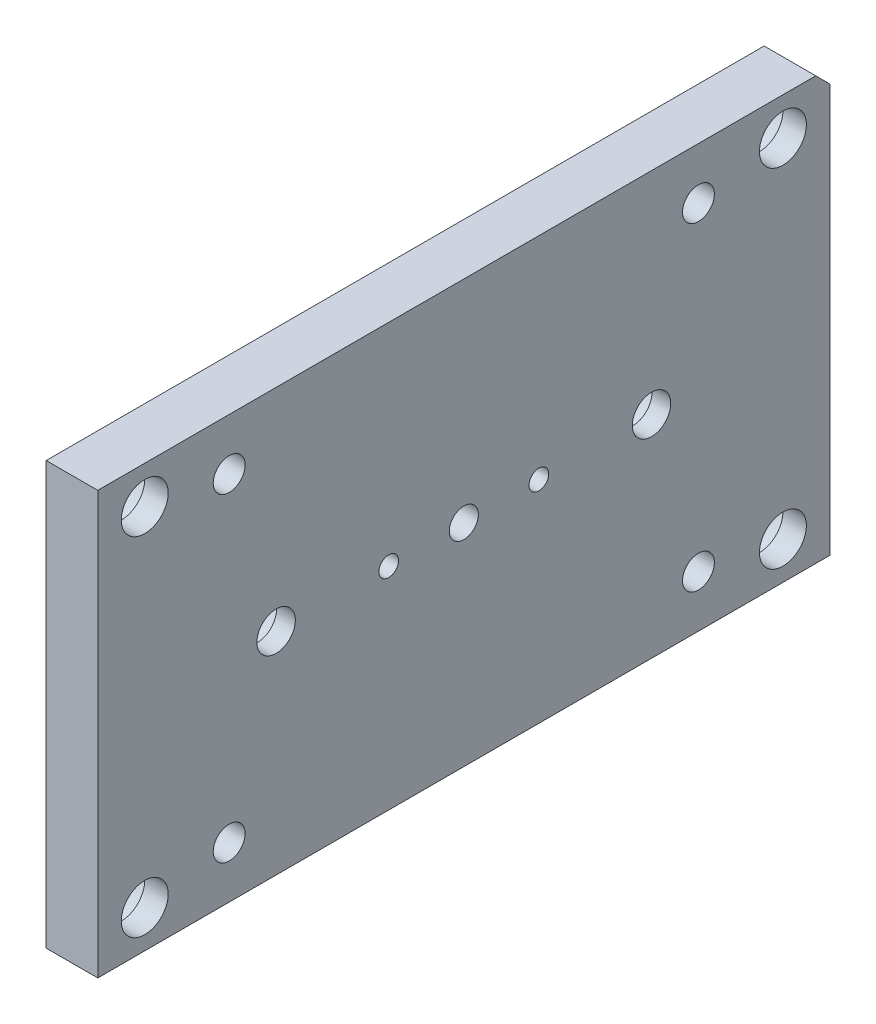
ISO-10303-21;
HEADER;
FILE_DESCRIPTION(('STEP AP214'),'2;1');
FILE_NAME('part.step','',(''),(''),'','','');
FILE_SCHEMA(('AUTOMOTIVE_DESIGN { 1 0 10303 214 1 1 1 1 }'));
ENDSEC;
DATA;
#1=APPLICATION_CONTEXT('core data for automotive mechanical design processes');
#2=APPLICATION_PROTOCOL_DEFINITION('international standard','automotive_design',2000,#1);
#3=PRODUCT_CONTEXT('',#1,'mechanical');
#4=PRODUCT('Part','Part','',(#3));
#5=PRODUCT_RELATED_PRODUCT_CATEGORY('part','',(#4));
#6=PRODUCT_DEFINITION_FORMATION('','',#4);
#7=PRODUCT_DEFINITION_CONTEXT('part definition',#1,'design');
#8=PRODUCT_DEFINITION('design','',#6,#7);
#9=PRODUCT_DEFINITION_SHAPE('','',#8);
#10=(LENGTH_UNIT() NAMED_UNIT(*) SI_UNIT(.MILLI.,.METRE.));
#11=(NAMED_UNIT(*) PLANE_ANGLE_UNIT() SI_UNIT($,.RADIAN.));
#12=(NAMED_UNIT(*) SI_UNIT($,.STERADIAN.) SOLID_ANGLE_UNIT());
#13=UNCERTAINTY_MEASURE_WITH_UNIT(LENGTH_MEASURE(1.E-05),#10,'distance_accuracy_value','');
#14=(GEOMETRIC_REPRESENTATION_CONTEXT(3) GLOBAL_UNCERTAINTY_ASSIGNED_CONTEXT((#13)) GLOBAL_UNIT_ASSIGNED_CONTEXT((#10,
#11,#12)) REPRESENTATION_CONTEXT('',''));
#15=CARTESIAN_POINT('',(0.,0.,0.));
#16=DIRECTION('',(0.,0.,1.));
#17=DIRECTION('',(1.,0.,0.));
#18=AXIS2_PLACEMENT_3D('',#15,#16,#17);
#19=CARTESIAN_POINT('',(11.,0.,40.));
#20=DIRECTION('',(-1.,0.,0.));
#21=DIRECTION('',(0.,0.,1.));
#22=AXIS2_PLACEMENT_3D('',#19,#20,#21);
#23=CYLINDRICAL_SURFACE('',#22,4.1);
#24=CARTESIAN_POINT('',(11.,0.,40.));
#25=DIRECTION('',(-1.,0.,0.));
#26=DIRECTION('',(0.,0.,1.));
#27=AXIS2_PLACEMENT_3D('',#24,#25,#26);
#28=CIRCLE('',#27,4.1);
#29=CARTESIAN_POINT('',(11.,0.,44.1));
#30=VERTEX_POINT('',#29);
#31=EDGE_CURVE('E236',#30,#30,#28,.T.);
#32=ORIENTED_EDGE('',*,*,#31,.F.);
#33=EDGE_LOOP('',(#32));
#34=FACE_BOUND('',#33,.T.);
#35=CARTESIAN_POINT('',(7.,0.,40.));
#36=DIRECTION('',(-1.,0.,0.));
#37=DIRECTION('',(0.,0.,1.));
#38=AXIS2_PLACEMENT_3D('',#35,#36,#37);
#39=CIRCLE('',#38,4.1);
#40=CARTESIAN_POINT('',(7.,0.,44.1));
#41=VERTEX_POINT('',#40);
#42=EDGE_CURVE('E149',#41,#41,#39,.F.);
#43=ORIENTED_EDGE('',*,*,#42,.F.);
#44=EDGE_LOOP('',(#43));
#45=FACE_BOUND('',#44,.T.);
#46=ADVANCED_FACE('F35',(#34,#45),#23,.F.);
#47=CARTESIAN_POINT('',(11.,0.,-40.));
#48=DIRECTION('',(-1.,0.,0.));
#49=DIRECTION('',(0.,0.,1.));
#50=AXIS2_PLACEMENT_3D('',#47,#48,#49);
#51=CYLINDRICAL_SURFACE('',#50,4.1);
#52=CARTESIAN_POINT('',(11.,0.,-40.));
#53=DIRECTION('',(-1.,0.,0.));
#54=DIRECTION('',(0.,0.,1.));
#55=AXIS2_PLACEMENT_3D('',#52,#53,#54);
#56=CIRCLE('',#55,4.1);
#57=CARTESIAN_POINT('',(11.,0.,-35.9));
#58=VERTEX_POINT('',#57);
#59=EDGE_CURVE('E242',#58,#58,#56,.T.);
#60=ORIENTED_EDGE('',*,*,#59,.F.);
#61=EDGE_LOOP('',(#60));
#62=FACE_BOUND('',#61,.T.);
#63=CARTESIAN_POINT('',(7.,0.,-40.));
#64=DIRECTION('',(-1.,0.,0.));
#65=DIRECTION('',(0.,0.,1.));
#66=AXIS2_PLACEMENT_3D('',#63,#64,#65);
#67=CIRCLE('',#66,4.1);
#68=CARTESIAN_POINT('',(7.,0.,-35.9));
#69=VERTEX_POINT('',#68);
#70=EDGE_CURVE('E144',#69,#69,#67,.F.);
#71=ORIENTED_EDGE('',*,*,#70,.F.);
#72=EDGE_LOOP('',(#71));
#73=FACE_BOUND('',#72,.T.);
#74=ADVANCED_FACE('F270',(#62,#73),#51,.F.);
#75=CARTESIAN_POINT('',(11.,0.,16.));
#76=DIRECTION('',(-1.,0.,0.));
#77=DIRECTION('',(0.,0.,1.));
#78=AXIS2_PLACEMENT_3D('',#75,#76,#77);
#79=CYLINDRICAL_SURFACE('',#78,2.1);
#80=CARTESIAN_POINT('',(11.,0.,16.));
#81=DIRECTION('',(-1.,0.,0.));
#82=DIRECTION('',(0.,0.,1.));
#83=AXIS2_PLACEMENT_3D('',#80,#81,#82);
#84=CIRCLE('',#83,2.1);
#85=CARTESIAN_POINT('',(11.,0.,18.1));
#86=VERTEX_POINT('',#85);
#87=EDGE_CURVE('E215',#86,#86,#84,.T.);
#88=ORIENTED_EDGE('',*,*,#87,.F.);
#89=EDGE_LOOP('',(#88));
#90=FACE_BOUND('',#89,.T.);
#91=CARTESIAN_POINT('',(4.,0.,16.));
#92=DIRECTION('',(-1.,0.,0.));
#93=DIRECTION('',(0.,0.,1.));
#94=AXIS2_PLACEMENT_3D('',#91,#92,#93);
#95=CIRCLE('',#94,2.1);
#96=CARTESIAN_POINT('',(4.,0.,18.1));
#97=VERTEX_POINT('',#96);
#98=EDGE_CURVE('E139',#97,#97,#95,.F.);
#99=ORIENTED_EDGE('',*,*,#98,.F.);
#100=EDGE_LOOP('',(#99));
#101=FACE_BOUND('',#100,.T.);
#102=ADVANCED_FACE('F276',(#90,#101),#79,.F.);
#103=CARTESIAN_POINT('',(11.,0.,-16.));
#104=DIRECTION('',(-1.,0.,0.));
#105=DIRECTION('',(0.,0.,1.));
#106=AXIS2_PLACEMENT_3D('',#103,#104,#105);
#107=CYLINDRICAL_SURFACE('',#106,2.1);
#108=CARTESIAN_POINT('',(11.,0.,-16.));
#109=DIRECTION('',(-1.,0.,0.));
#110=DIRECTION('',(0.,0.,1.));
#111=AXIS2_PLACEMENT_3D('',#108,#109,#110);
#112=CIRCLE('',#111,2.1);
#113=CARTESIAN_POINT('',(11.,0.,-13.9));
#114=VERTEX_POINT('',#113);
#115=EDGE_CURVE('E218',#114,#114,#112,.T.);
#116=ORIENTED_EDGE('',*,*,#115,.F.);
#117=EDGE_LOOP('',(#116));
#118=FACE_BOUND('',#117,.T.);
#119=CARTESIAN_POINT('',(4.,0.,-16.));
#120=DIRECTION('',(-1.,0.,0.));
#121=DIRECTION('',(0.,0.,1.));
#122=AXIS2_PLACEMENT_3D('',#119,#120,#121);
#123=CIRCLE('',#122,2.1);
#124=CARTESIAN_POINT('',(4.,0.,-13.9));
#125=VERTEX_POINT('',#124);
#126=EDGE_CURVE('E134',#125,#125,#123,.F.);
#127=ORIENTED_EDGE('',*,*,#126,.F.);
#128=EDGE_LOOP('',(#127));
#129=FACE_BOUND('',#128,.T.);
#130=ADVANCED_FACE('F339',(#118,#129),#107,.F.);
#131=CARTESIAN_POINT('',(11.,-37.,-68.));
#132=DIRECTION('',(-1.,0.,0.));
#133=DIRECTION('',(0.,0.,1.));
#134=AXIS2_PLACEMENT_3D('',#131,#132,#133);
#135=CYLINDRICAL_SURFACE('',#134,4.99999999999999);
#136=CARTESIAN_POINT('',(11.,-37.,-68.));
#137=DIRECTION('',(-1.,0.,0.));
#138=DIRECTION('',(0.,0.,1.));
#139=AXIS2_PLACEMENT_3D('',#136,#137,#138);
#140=CIRCLE('',#139,4.99999999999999);
#141=CARTESIAN_POINT('',(11.,-37.,-63.));
#142=VERTEX_POINT('',#141);
#143=EDGE_CURVE('E225',#142,#142,#140,.T.);
#144=ORIENTED_EDGE('',*,*,#143,.F.);
#145=EDGE_LOOP('',(#144));
#146=FACE_BOUND('',#145,.T.);
#147=CARTESIAN_POINT('',(6.,-37.,-68.));
#148=DIRECTION('',(-1.,0.,0.));
#149=DIRECTION('',(0.,0.,1.));
#150=AXIS2_PLACEMENT_3D('',#147,#148,#149);
#151=CIRCLE('',#150,4.99999999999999);
#152=CARTESIAN_POINT('',(6.,-37.,-63.));
#153=VERTEX_POINT('',#152);
#154=EDGE_CURVE('E129',#153,#153,#151,.F.);
#155=ORIENTED_EDGE('',*,*,#154,.F.);
#156=EDGE_LOOP('',(#155));
#157=FACE_BOUND('',#156,.T.);
#158=ADVANCED_FACE('F342',(#146,#157),#135,.F.);
#159=CARTESIAN_POINT('',(11.,-37.,68.));
#160=DIRECTION('',(-1.,0.,0.));
#161=DIRECTION('',(0.,0.,1.));
#162=AXIS2_PLACEMENT_3D('',#159,#160,#161);
#163=CYLINDRICAL_SURFACE('',#162,4.99999999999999);
#164=CARTESIAN_POINT('',(11.,-37.,68.));
#165=DIRECTION('',(-1.,0.,0.));
#166=DIRECTION('',(0.,0.,1.));
#167=AXIS2_PLACEMENT_3D('',#164,#165,#166);
#168=CIRCLE('',#167,4.99999999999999);
#169=CARTESIAN_POINT('',(11.,-37.,73.));
#170=VERTEX_POINT('',#169);
#171=EDGE_CURVE('E230',#170,#170,#168,.T.);
#172=ORIENTED_EDGE('',*,*,#171,.F.);
#173=EDGE_LOOP('',(#172));
#174=FACE_BOUND('',#173,.T.);
#175=CARTESIAN_POINT('',(6.,-37.,68.));
#176=DIRECTION('',(-1.,0.,0.));
#177=DIRECTION('',(0.,0.,1.));
#178=AXIS2_PLACEMENT_3D('',#175,#176,#177);
#179=CIRCLE('',#178,4.99999999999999);
#180=CARTESIAN_POINT('',(6.,-37.,73.));
#181=VERTEX_POINT('',#180);
#182=EDGE_CURVE('E124',#181,#181,#179,.F.);
#183=ORIENTED_EDGE('',*,*,#182,.F.);
#184=EDGE_LOOP('',(#183));
#185=FACE_BOUND('',#184,.T.);
#186=ADVANCED_FACE('F346',(#174,#185),#163,.F.);
#187=CARTESIAN_POINT('',(11.,37.,68.));
#188=DIRECTION('',(-1.,0.,0.));
#189=DIRECTION('',(0.,0.,1.));
#190=AXIS2_PLACEMENT_3D('',#187,#188,#189);
#191=CYLINDRICAL_SURFACE('',#190,4.99999999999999);
#192=CARTESIAN_POINT('',(11.,37.,68.));
#193=DIRECTION('',(-1.,0.,0.));
#194=DIRECTION('',(0.,0.,1.));
#195=AXIS2_PLACEMENT_3D('',#192,#193,#194);
#196=CIRCLE('',#195,4.99999999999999);
#197=CARTESIAN_POINT('',(11.,37.,73.));
#198=VERTEX_POINT('',#197);
#199=EDGE_CURVE('E233',#198,#198,#196,.T.);
#200=ORIENTED_EDGE('',*,*,#199,.F.);
#201=EDGE_LOOP('',(#200));
#202=FACE_BOUND('',#201,.T.);
#203=CARTESIAN_POINT('',(6.,37.,68.));
#204=DIRECTION('',(-1.,0.,0.));
#205=DIRECTION('',(0.,0.,1.));
#206=AXIS2_PLACEMENT_3D('',#203,#204,#205);
#207=CIRCLE('',#206,4.99999999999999);
#208=CARTESIAN_POINT('',(6.,37.,73.));
#209=VERTEX_POINT('',#208);
#210=EDGE_CURVE('E119',#209,#209,#207,.F.);
#211=ORIENTED_EDGE('',*,*,#210,.F.);
#212=EDGE_LOOP('',(#211));
#213=FACE_BOUND('',#212,.T.);
#214=ADVANCED_FACE('F283',(#202,#213),#191,.F.);
#215=CARTESIAN_POINT('',(11.,37.,-68.));
#216=DIRECTION('',(-1.,0.,0.));
#217=DIRECTION('',(0.,0.,1.));
#218=AXIS2_PLACEMENT_3D('',#215,#216,#217);
#219=CYLINDRICAL_SURFACE('',#218,4.99999999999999);
#220=CARTESIAN_POINT('',(11.,37.,-68.));
#221=DIRECTION('',(-1.,0.,0.));
#222=DIRECTION('',(0.,0.,1.));
#223=AXIS2_PLACEMENT_3D('',#220,#221,#222);
#224=CIRCLE('',#223,4.99999999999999);
#225=CARTESIAN_POINT('',(11.,37.,-63.));
#226=VERTEX_POINT('',#225);
#227=EDGE_CURVE('E239',#226,#226,#224,.T.);
#228=ORIENTED_EDGE('',*,*,#227,.F.);
#229=EDGE_LOOP('',(#228));
#230=FACE_BOUND('',#229,.T.);
#231=CARTESIAN_POINT('',(6.,37.,-68.));
#232=DIRECTION('',(-1.,0.,0.));
#233=DIRECTION('',(0.,0.,1.));
#234=AXIS2_PLACEMENT_3D('',#231,#232,#233);
#235=CIRCLE('',#234,4.99999999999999);
#236=CARTESIAN_POINT('',(6.,37.,-63.));
#237=VERTEX_POINT('',#236);
#238=EDGE_CURVE('E114',#237,#237,#235,.F.);
#239=ORIENTED_EDGE('',*,*,#238,.F.);
#240=EDGE_LOOP('',(#239));
#241=FACE_BOUND('',#240,.T.);
#242=ADVANCED_FACE('F285',(#230,#241),#219,.F.);
#243=CARTESIAN_POINT('',(11.,45.,78.));
#244=DIRECTION('',(0.,0.,-1.));
#245=DIRECTION('',(-1.,0.,0.));
#246=AXIS2_PLACEMENT_3D('',#243,#244,#245);
#247=PLANE('',#246);
#248=DIRECTION('',(0.,-1.,0.));
#249=VECTOR('',#248,1.);
#250=CARTESIAN_POINT('',(0.,45.,78.));
#251=LINE('',#250,#249);
#252=CARTESIAN_POINT('',(0.,45.,78.));
#253=VERTEX_POINT('',#252);
#254=CARTESIAN_POINT('',(0.,-45.,78.));
#255=VERTEX_POINT('',#254);
#256=EDGE_CURVE('E105',#253,#255,#251,.T.);
#257=ORIENTED_EDGE('',*,*,#256,.T.);
#258=DIRECTION('',(-1.,0.,0.));
#259=VECTOR('',#258,1.);
#260=CARTESIAN_POINT('',(11.,-45.,78.));
#261=LINE('',#260,#259);
#262=CARTESIAN_POINT('',(11.,-45.,78.));
#263=VERTEX_POINT('',#262);
#264=EDGE_CURVE('E86',#263,#255,#261,.T.);
#265=ORIENTED_EDGE('',*,*,#264,.F.);
#266=DIRECTION('',(0.,-1.,0.));
#267=VECTOR('',#266,1.);
#268=CARTESIAN_POINT('',(11.,45.,78.));
#269=LINE('',#268,#267);
#270=CARTESIAN_POINT('',(11.,45.,78.));
#271=VERTEX_POINT('',#270);
#272=EDGE_CURVE('E92',#271,#263,#269,.T.);
#273=ORIENTED_EDGE('',*,*,#272,.F.);
#274=DIRECTION('',(-1.,0.,0.));
#275=VECTOR('',#274,1.);
#276=CARTESIAN_POINT('',(11.,45.,78.));
#277=LINE('',#276,#275);
#278=EDGE_CURVE('E110',#271,#253,#277,.T.);
#279=ORIENTED_EDGE('',*,*,#278,.T.);
#280=EDGE_LOOP('',(#257,#265,#273,#279));
#281=FACE_BOUND('',#280,.T.);
#282=ADVANCED_FACE('F103',(#281),#247,.F.);
#283=CARTESIAN_POINT('',(11.,-45.,78.));
#284=DIRECTION('',(0.,1.,0.));
#285=DIRECTION('',(0.,0.,1.));
#286=AXIS2_PLACEMENT_3D('',#283,#284,#285);
#287=PLANE('',#286);
#288=DIRECTION('',(0.,0.,-1.));
#289=VECTOR('',#288,1.);
#290=CARTESIAN_POINT('',(0.,-45.,78.));
#291=LINE('',#290,#289);
#292=CARTESIAN_POINT('',(0.,-45.,-78.));
#293=VERTEX_POINT('',#292);
#294=EDGE_CURVE('E248',#255,#293,#291,.T.);
#295=ORIENTED_EDGE('',*,*,#294,.T.);
#296=DIRECTION('',(-1.,0.,0.));
#297=VECTOR('',#296,1.);
#298=CARTESIAN_POINT('',(11.,-45.,-78.));
#299=LINE('',#298,#297);
#300=CARTESIAN_POINT('',(11.,-45.,-78.));
#301=VERTEX_POINT('',#300);
#302=EDGE_CURVE('E89',#301,#293,#299,.T.);
#303=ORIENTED_EDGE('',*,*,#302,.F.);
#304=DIRECTION('',(0.,0.,-1.));
#305=VECTOR('',#304,1.);
#306=CARTESIAN_POINT('',(11.,-45.,78.));
#307=LINE('',#306,#305);
#308=EDGE_CURVE('E82',#263,#301,#307,.T.);
#309=ORIENTED_EDGE('',*,*,#308,.F.);
#310=ORIENTED_EDGE('',*,*,#264,.T.);
#311=EDGE_LOOP('',(#295,#303,#309,#310));
#312=FACE_BOUND('',#311,.T.);
#313=ADVANCED_FACE('F84',(#312),#287,.F.);
#314=CARTESIAN_POINT('',(11.,45.,-78.));
#315=DIRECTION('',(0.,0.,1.));
#316=DIRECTION('',(1.,0.,0.));
#317=AXIS2_PLACEMENT_3D('',#314,#315,#316);
#318=PLANE('',#317);
#319=DIRECTION('',(0.,1.,0.));
#320=VECTOR('',#319,1.);
#321=CARTESIAN_POINT('',(0.,45.,-78.));
#322=LINE('',#321,#320);
#323=CARTESIAN_POINT('',(0.,42.,-78.));
#324=VERTEX_POINT('',#323);
#325=EDGE_CURVE('E250',#293,#324,#322,.T.);
#326=ORIENTED_EDGE('',*,*,#325,.T.);
#327=DIRECTION('',(1.,0.,0.));
#328=VECTOR('',#327,1.);
#329=CARTESIAN_POINT('',(11.,42.,-78.));
#330=LINE('',#329,#328);
#331=CARTESIAN_POINT('',(11.,42.,-78.));
#332=VERTEX_POINT('',#331);
#333=EDGE_CURVE('E43',#324,#332,#330,.T.);
#334=ORIENTED_EDGE('',*,*,#333,.T.);
#335=DIRECTION('',(0.,1.,0.));
#336=VECTOR('',#335,1.);
#337=CARTESIAN_POINT('',(11.,45.,-78.));
#338=LINE('',#337,#336);
#339=EDGE_CURVE('E91',#301,#332,#338,.T.);
#340=ORIENTED_EDGE('',*,*,#339,.F.);
#341=ORIENTED_EDGE('',*,*,#302,.T.);
#342=EDGE_LOOP('',(#326,#334,#340,#341));
#343=FACE_BOUND('',#342,.T.);
#344=ADVANCED_FACE('F254',(#343),#318,.F.);
#345=CARTESIAN_POINT('',(11.,45.,78.));
#346=DIRECTION('',(0.,-1.,0.));
#347=DIRECTION('',(0.,0.,-1.));
#348=AXIS2_PLACEMENT_3D('',#345,#346,#347);
#349=PLANE('',#348);
#350=DIRECTION('',(0.,0.,1.));
#351=VECTOR('',#350,1.);
#352=CARTESIAN_POINT('',(11.,45.,78.));
#353=LINE('',#352,#351);
#354=CARTESIAN_POINT('',(11.,45.,-75.));
#355=VERTEX_POINT('',#354);
#356=EDGE_CURVE('E97',#355,#271,#353,.T.);
#357=ORIENTED_EDGE('',*,*,#356,.F.);
#358=DIRECTION('',(-1.,0.,0.));
#359=VECTOR('',#358,1.);
#360=CARTESIAN_POINT('',(11.,45.,-75.));
#361=LINE('',#360,#359);
#362=CARTESIAN_POINT('',(0.,45.,-75.));
#363=VERTEX_POINT('',#362);
#364=EDGE_CURVE('E106',#355,#363,#361,.T.);
#365=ORIENTED_EDGE('',*,*,#364,.T.);
#366=DIRECTION('',(0.,0.,1.));
#367=VECTOR('',#366,1.);
#368=CARTESIAN_POINT('',(0.,45.,78.));
#369=LINE('',#368,#367);
#370=EDGE_CURVE('E101',#363,#253,#369,.T.);
#371=ORIENTED_EDGE('',*,*,#370,.T.);
#372=ORIENTED_EDGE('',*,*,#278,.F.);
#373=EDGE_LOOP('',(#357,#365,#371,#372));
#374=FACE_BOUND('',#373,.T.);
#375=ADVANCED_FACE('F258',(#374),#349,.F.);
#376=CARTESIAN_POINT('',(11.,-45.,78.));
#377=DIRECTION('',(1.,0.,0.));
#378=DIRECTION('',(0.,0.,-1.));
#379=AXIS2_PLACEMENT_3D('',#376,#377,#378);
#380=PLANE('',#379);
#381=CARTESIAN_POINT('',(11.,34.,50.));
#382=DIRECTION('',(-1.,0.,0.));
#383=DIRECTION('',(0.,0.,1.));
#384=AXIS2_PLACEMENT_3D('',#381,#382,#383);
#385=CIRCLE('',#384,3.4);
#386=CARTESIAN_POINT('',(11.,34.,53.4));
#387=VERTEX_POINT('',#386);
#388=EDGE_CURVE('E117',#387,#387,#385,.T.);
#389=ORIENTED_EDGE('',*,*,#388,.T.);
#390=EDGE_LOOP('',(#389));
#391=FACE_BOUND('',#390,.T.);
#392=CARTESIAN_POINT('',(11.,34.,-50.));
#393=DIRECTION('',(-1.,0.,0.));
#394=DIRECTION('',(0.,0.,1.));
#395=AXIS2_PLACEMENT_3D('',#392,#393,#394);
#396=CIRCLE('',#395,3.4);
#397=CARTESIAN_POINT('',(11.,34.,-46.6));
#398=VERTEX_POINT('',#397);
#399=EDGE_CURVE('E197',#398,#398,#396,.T.);
#400=ORIENTED_EDGE('',*,*,#399,.T.);
#401=EDGE_LOOP('',(#400));
#402=FACE_BOUND('',#401,.T.);
#403=CARTESIAN_POINT('',(11.,-34.,-50.));
#404=DIRECTION('',(-1.,0.,0.));
#405=DIRECTION('',(0.,0.,1.));
#406=AXIS2_PLACEMENT_3D('',#403,#404,#405);
#407=CIRCLE('',#406,3.4);
#408=CARTESIAN_POINT('',(11.,-34.,-46.6));
#409=VERTEX_POINT('',#408);
#410=EDGE_CURVE('E203',#409,#409,#407,.T.);
#411=ORIENTED_EDGE('',*,*,#410,.T.);
#412=EDGE_LOOP('',(#411));
#413=FACE_BOUND('',#412,.T.);
#414=CARTESIAN_POINT('',(11.,-34.,50.));
#415=DIRECTION('',(-1.,0.,0.));
#416=DIRECTION('',(0.,0.,1.));
#417=AXIS2_PLACEMENT_3D('',#414,#415,#416);
#418=CIRCLE('',#417,3.4);
#419=CARTESIAN_POINT('',(11.,-34.,53.4));
#420=VERTEX_POINT('',#419);
#421=EDGE_CURVE('E209',#420,#420,#418,.T.);
#422=ORIENTED_EDGE('',*,*,#421,.T.);
#423=EDGE_LOOP('',(#422));
#424=FACE_BOUND('',#423,.T.);
#425=ORIENTED_EDGE('',*,*,#87,.T.);
#426=EDGE_LOOP('',(#425));
#427=FACE_BOUND('',#426,.T.);
#428=ORIENTED_EDGE('',*,*,#115,.T.);
#429=EDGE_LOOP('',(#428));
#430=FACE_BOUND('',#429,.T.);
#431=CARTESIAN_POINT('',(11.,0.,0.));
#432=DIRECTION('',(-1.,0.,0.));
#433=DIRECTION('',(0.,0.,1.));
#434=AXIS2_PLACEMENT_3D('',#431,#432,#433);
#435=CIRCLE('',#434,3.1);
#436=CARTESIAN_POINT('',(11.,0.,3.09999999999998));
#437=VERTEX_POINT('',#436);
#438=EDGE_CURVE('E222',#437,#437,#435,.T.);
#439=ORIENTED_EDGE('',*,*,#438,.T.);
#440=EDGE_LOOP('',(#439));
#441=FACE_BOUND('',#440,.T.);
#442=ORIENTED_EDGE('',*,*,#143,.T.);
#443=EDGE_LOOP('',(#442));
#444=FACE_BOUND('',#443,.T.);
#445=ORIENTED_EDGE('',*,*,#171,.T.);
#446=EDGE_LOOP('',(#445));
#447=FACE_BOUND('',#446,.T.);
#448=ORIENTED_EDGE('',*,*,#199,.T.);
#449=EDGE_LOOP('',(#448));
#450=FACE_BOUND('',#449,.T.);
#451=ORIENTED_EDGE('',*,*,#31,.T.);
#452=EDGE_LOOP('',(#451));
#453=FACE_BOUND('',#452,.T.);
#454=ORIENTED_EDGE('',*,*,#227,.T.);
#455=EDGE_LOOP('',(#454));
#456=FACE_BOUND('',#455,.T.);
#457=ORIENTED_EDGE('',*,*,#59,.T.);
#458=EDGE_LOOP('',(#457));
#459=FACE_BOUND('',#458,.T.);
#460=ORIENTED_EDGE('',*,*,#339,.T.);
#461=DIRECTION('',(0.,-0.707106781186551,-0.707106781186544));
#462=VECTOR('',#461,1.);
#463=CARTESIAN_POINT('',(11.,76.4999999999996,-43.5000000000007));
#464=LINE('',#463,#462);
#465=EDGE_CURVE('E11',#332,#355,#464,.F.);
#466=ORIENTED_EDGE('',*,*,#465,.T.);
#467=ORIENTED_EDGE('',*,*,#356,.T.);
#468=ORIENTED_EDGE('',*,*,#272,.T.);
#469=ORIENTED_EDGE('',*,*,#308,.T.);
#470=EDGE_LOOP('',(#460,#466,#467,#468,#469));
#471=FACE_BOUND('',#470,.T.);
#472=ADVANCED_FACE('F95',(#391,#402,#413,#424,#427,#430,#441,#444,#447,#450,#453,#456,#459,
#471),#380,.T.);
#473=CARTESIAN_POINT('',(0.,-45.,78.));
#474=DIRECTION('',(1.,0.,0.));
#475=DIRECTION('',(0.,0.,-1.));
#476=AXIS2_PLACEMENT_3D('',#473,#474,#475);
#477=PLANE('',#476);
#478=CARTESIAN_POINT('',(0.,0.,40.));
#479=DIRECTION('',(-1.,0.,0.));
#480=DIRECTION('',(0.,0.,1.));
#481=AXIS2_PLACEMENT_3D('',#478,#479,#480);
#482=CIRCLE('',#481,7.5);
#483=CARTESIAN_POINT('',(0.,0.,47.5));
#484=VERTEX_POINT('',#483);
#485=EDGE_CURVE('E159',#484,#484,#482,.T.);
#486=ORIENTED_EDGE('',*,*,#485,.F.);
#487=EDGE_LOOP('',(#486));
#488=FACE_BOUND('',#487,.T.);
#489=CARTESIAN_POINT('',(0.,0.,-40.));
#490=DIRECTION('',(-1.,0.,0.));
#491=DIRECTION('',(0.,0.,1.));
#492=AXIS2_PLACEMENT_3D('',#489,#490,#491);
#493=CIRCLE('',#492,7.5);
#494=CARTESIAN_POINT('',(0.,0.,-32.5));
#495=VERTEX_POINT('',#494);
#496=EDGE_CURVE('E151',#495,#495,#493,.T.);
#497=ORIENTED_EDGE('',*,*,#496,.F.);
#498=EDGE_LOOP('',(#497));
#499=FACE_BOUND('',#498,.T.);
#500=CARTESIAN_POINT('',(0.,0.,16.));
#501=DIRECTION('',(-1.,0.,0.));
#502=DIRECTION('',(0.,0.,1.));
#503=AXIS2_PLACEMENT_3D('',#500,#501,#502);
#504=CIRCLE('',#503,4.25);
#505=CARTESIAN_POINT('',(0.,0.,20.25));
#506=VERTEX_POINT('',#505);
#507=EDGE_CURVE('E147',#506,#506,#504,.T.);
#508=ORIENTED_EDGE('',*,*,#507,.F.);
#509=EDGE_LOOP('',(#508));
#510=FACE_BOUND('',#509,.T.);
#511=CARTESIAN_POINT('',(0.,0.,-16.));
#512=DIRECTION('',(-1.,0.,0.));
#513=DIRECTION('',(0.,0.,1.));
#514=AXIS2_PLACEMENT_3D('',#511,#512,#513);
#515=CIRCLE('',#514,4.25);
#516=CARTESIAN_POINT('',(0.,0.,-11.75));
#517=VERTEX_POINT('',#516);
#518=EDGE_CURVE('E142',#517,#517,#515,.T.);
#519=ORIENTED_EDGE('',*,*,#518,.F.);
#520=EDGE_LOOP('',(#519));
#521=FACE_BOUND('',#520,.T.);
#522=CARTESIAN_POINT('',(0.,-37.,-68.));
#523=DIRECTION('',(-1.,0.,0.));
#524=DIRECTION('',(0.,0.,1.));
#525=AXIS2_PLACEMENT_3D('',#522,#523,#524);
#526=CIRCLE('',#525,7.5);
#527=CARTESIAN_POINT('',(0.,-37.,-60.5));
#528=VERTEX_POINT('',#527);
#529=EDGE_CURVE('E137',#528,#528,#526,.T.);
#530=ORIENTED_EDGE('',*,*,#529,.F.);
#531=EDGE_LOOP('',(#530));
#532=FACE_BOUND('',#531,.T.);
#533=CARTESIAN_POINT('',(0.,-37.,68.));
#534=DIRECTION('',(-1.,0.,0.));
#535=DIRECTION('',(0.,0.,1.));
#536=AXIS2_PLACEMENT_3D('',#533,#534,#535);
#537=CIRCLE('',#536,7.50000000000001);
#538=CARTESIAN_POINT('',(0.,-37.,75.5));
#539=VERTEX_POINT('',#538);
#540=EDGE_CURVE('E132',#539,#539,#537,.T.);
#541=ORIENTED_EDGE('',*,*,#540,.F.);
#542=EDGE_LOOP('',(#541));
#543=FACE_BOUND('',#542,.T.);
#544=CARTESIAN_POINT('',(0.,37.,68.));
#545=DIRECTION('',(-1.,0.,0.));
#546=DIRECTION('',(0.,0.,1.));
#547=AXIS2_PLACEMENT_3D('',#544,#545,#546);
#548=CIRCLE('',#547,7.50000000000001);
#549=CARTESIAN_POINT('',(0.,37.,75.5));
#550=VERTEX_POINT('',#549);
#551=EDGE_CURVE('E127',#550,#550,#548,.T.);
#552=ORIENTED_EDGE('',*,*,#551,.F.);
#553=EDGE_LOOP('',(#552));
#554=FACE_BOUND('',#553,.T.);
#555=CARTESIAN_POINT('',(0.,37.,-68.));
#556=DIRECTION('',(-1.,0.,0.));
#557=DIRECTION('',(0.,0.,1.));
#558=AXIS2_PLACEMENT_3D('',#555,#556,#557);
#559=CIRCLE('',#558,7.5);
#560=CARTESIAN_POINT('',(0.,37.,-60.5));
#561=VERTEX_POINT('',#560);
#562=EDGE_CURVE('E122',#561,#561,#559,.T.);
#563=ORIENTED_EDGE('',*,*,#562,.F.);
#564=EDGE_LOOP('',(#563));
#565=FACE_BOUND('',#564,.T.);
#566=CARTESIAN_POINT('',(0.,34.,50.));
#567=DIRECTION('',(-1.,0.,0.));
#568=DIRECTION('',(0.,0.,1.));
#569=AXIS2_PLACEMENT_3D('',#566,#567,#568);
#570=CIRCLE('',#569,3.39999999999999);
#571=CARTESIAN_POINT('',(0.,34.,53.4));
#572=VERTEX_POINT('',#571);
#573=EDGE_CURVE('E194',#572,#572,#570,.T.);
#574=ORIENTED_EDGE('',*,*,#573,.F.);
#575=EDGE_LOOP('',(#574));
#576=FACE_BOUND('',#575,.T.);
#577=CARTESIAN_POINT('',(0.,34.,-50.));
#578=DIRECTION('',(-1.,0.,0.));
#579=DIRECTION('',(0.,0.,1.));
#580=AXIS2_PLACEMENT_3D('',#577,#578,#579);
#581=CIRCLE('',#580,3.39999999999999);
#582=CARTESIAN_POINT('',(0.,34.,-46.6));
#583=VERTEX_POINT('',#582);
#584=EDGE_CURVE('E200',#583,#583,#581,.T.);
#585=ORIENTED_EDGE('',*,*,#584,.F.);
#586=EDGE_LOOP('',(#585));
#587=FACE_BOUND('',#586,.T.);
#588=CARTESIAN_POINT('',(0.,-34.,-50.));
#589=DIRECTION('',(-1.,0.,0.));
#590=DIRECTION('',(0.,0.,1.));
#591=AXIS2_PLACEMENT_3D('',#588,#589,#590);
#592=CIRCLE('',#591,3.39999999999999);
#593=CARTESIAN_POINT('',(0.,-34.,-46.6));
#594=VERTEX_POINT('',#593);
#595=EDGE_CURVE('E206',#594,#594,#592,.T.);
#596=ORIENTED_EDGE('',*,*,#595,.F.);
#597=EDGE_LOOP('',(#596));
#598=FACE_BOUND('',#597,.T.);
#599=CARTESIAN_POINT('',(0.,-34.,50.));
#600=DIRECTION('',(-1.,0.,0.));
#601=DIRECTION('',(0.,0.,1.));
#602=AXIS2_PLACEMENT_3D('',#599,#600,#601);
#603=CIRCLE('',#602,3.39999999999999);
#604=CARTESIAN_POINT('',(0.,-34.,53.4));
#605=VERTEX_POINT('',#604);
#606=EDGE_CURVE('E212',#605,#605,#603,.T.);
#607=ORIENTED_EDGE('',*,*,#606,.F.);
#608=EDGE_LOOP('',(#607));
#609=FACE_BOUND('',#608,.T.);
#610=CARTESIAN_POINT('',(0.,0.,0.));
#611=DIRECTION('',(-1.,0.,0.));
#612=DIRECTION('',(0.,0.,1.));
#613=AXIS2_PLACEMENT_3D('',#610,#611,#612);
#614=CIRCLE('',#613,3.1);
#615=CARTESIAN_POINT('',(0.,0.,3.09999999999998));
#616=VERTEX_POINT('',#615);
#617=EDGE_CURVE('E221',#616,#616,#614,.T.);
#618=ORIENTED_EDGE('',*,*,#617,.F.);
#619=EDGE_LOOP('',(#618));
#620=FACE_BOUND('',#619,.T.);
#621=ORIENTED_EDGE('',*,*,#370,.F.);
#622=DIRECTION('',(0.,0.707106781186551,0.707106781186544));
#623=VECTOR('',#622,1.);
#624=CARTESIAN_POINT('',(0.,45.,-75.));
#625=LINE('',#624,#623);
#626=EDGE_CURVE('E57',#363,#324,#625,.F.);
#627=ORIENTED_EDGE('',*,*,#626,.T.);
#628=ORIENTED_EDGE('',*,*,#325,.F.);
#629=ORIENTED_EDGE('',*,*,#294,.F.);
#630=ORIENTED_EDGE('',*,*,#256,.F.);
#631=EDGE_LOOP('',(#621,#627,#628,#629,#630));
#632=FACE_BOUND('',#631,.T.);
#633=ADVANCED_FACE('F253',(#488,#499,#510,#521,#532,#543,#554,#565,#576,#587,#598,#609,#620,
#632),#477,.F.);
#634=CARTESIAN_POINT('',(11.,0.,0.));
#635=DIRECTION('',(-1.,0.,0.));
#636=DIRECTION('',(0.,0.,1.));
#637=AXIS2_PLACEMENT_3D('',#634,#635,#636);
#638=CYLINDRICAL_SURFACE('',#637,3.1);
#639=ORIENTED_EDGE('',*,*,#438,.F.);
#640=EDGE_LOOP('',(#639));
#641=FACE_BOUND('',#640,.T.);
#642=ORIENTED_EDGE('',*,*,#617,.T.);
#643=EDGE_LOOP('',(#642));
#644=FACE_BOUND('',#643,.T.);
#645=ADVANCED_FACE('F289',(#641,#644),#638,.F.);
#646=CARTESIAN_POINT('',(0.,-34.,50.));
#647=DIRECTION('',(-1.,0.,0.));
#648=DIRECTION('',(0.,0.,1.));
#649=AXIS2_PLACEMENT_3D('',#646,#647,#648);
#650=CYLINDRICAL_SURFACE('',#649,3.39999999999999);
#651=ORIENTED_EDGE('',*,*,#421,.F.);
#652=EDGE_LOOP('',(#651));
#653=FACE_BOUND('',#652,.T.);
#654=ORIENTED_EDGE('',*,*,#606,.T.);
#655=EDGE_LOOP('',(#654));
#656=FACE_BOUND('',#655,.T.);
#657=ADVANCED_FACE('F294',(#653,#656),#650,.F.);
#658=CARTESIAN_POINT('',(0.,-34.,-50.));
#659=DIRECTION('',(-1.,0.,0.));
#660=DIRECTION('',(0.,0.,1.));
#661=AXIS2_PLACEMENT_3D('',#658,#659,#660);
#662=CYLINDRICAL_SURFACE('',#661,3.39999999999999);
#663=ORIENTED_EDGE('',*,*,#410,.F.);
#664=EDGE_LOOP('',(#663));
#665=FACE_BOUND('',#664,.T.);
#666=ORIENTED_EDGE('',*,*,#595,.T.);
#667=EDGE_LOOP('',(#666));
#668=FACE_BOUND('',#667,.T.);
#669=ADVANCED_FACE('F325',(#665,#668),#662,.F.);
#670=CARTESIAN_POINT('',(0.,34.,-50.));
#671=DIRECTION('',(-1.,0.,0.));
#672=DIRECTION('',(0.,0.,1.));
#673=AXIS2_PLACEMENT_3D('',#670,#671,#672);
#674=CYLINDRICAL_SURFACE('',#673,3.39999999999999);
#675=ORIENTED_EDGE('',*,*,#399,.F.);
#676=EDGE_LOOP('',(#675));
#677=FACE_BOUND('',#676,.T.);
#678=ORIENTED_EDGE('',*,*,#584,.T.);
#679=EDGE_LOOP('',(#678));
#680=FACE_BOUND('',#679,.T.);
#681=ADVANCED_FACE('F331',(#677,#680),#674,.F.);
#682=CARTESIAN_POINT('',(0.,34.,50.));
#683=DIRECTION('',(-1.,0.,0.));
#684=DIRECTION('',(0.,0.,1.));
#685=AXIS2_PLACEMENT_3D('',#682,#683,#684);
#686=CYLINDRICAL_SURFACE('',#685,3.39999999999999);
#687=ORIENTED_EDGE('',*,*,#388,.F.);
#688=EDGE_LOOP('',(#687));
#689=FACE_BOUND('',#688,.T.);
#690=ORIENTED_EDGE('',*,*,#573,.T.);
#691=EDGE_LOOP('',(#690));
#692=FACE_BOUND('',#691,.T.);
#693=ADVANCED_FACE('F385',(#689,#692),#686,.F.);
#694=CARTESIAN_POINT('',(6.,37.,-68.));
#695=DIRECTION('',(-1.,0.,0.));
#696=DIRECTION('',(0.,0.,1.));
#697=AXIS2_PLACEMENT_3D('',#694,#695,#696);
#698=PLANE('',#697);
#699=CARTESIAN_POINT('',(6.,37.,-68.));
#700=DIRECTION('',(-1.,0.,0.));
#701=DIRECTION('',(0.,0.,1.));
#702=AXIS2_PLACEMENT_3D('',#699,#700,#701);
#703=CIRCLE('',#702,7.5);
#704=CARTESIAN_POINT('',(6.,37.,-60.5));
#705=VERTEX_POINT('',#704);
#706=EDGE_CURVE('E118',#705,#705,#703,.T.);
#707=ORIENTED_EDGE('',*,*,#706,.T.);
#708=EDGE_LOOP('',(#707));
#709=FACE_BOUND('',#708,.T.);
#710=ORIENTED_EDGE('',*,*,#238,.T.);
#711=EDGE_LOOP('',(#710));
#712=FACE_BOUND('',#711,.T.);
#713=ADVANCED_FACE('F382',(#709,#712),#698,.T.);
#714=CARTESIAN_POINT('',(6.,37.,-68.));
#715=DIRECTION('',(-1.,0.,0.));
#716=DIRECTION('',(0.,0.,1.));
#717=AXIS2_PLACEMENT_3D('',#714,#715,#716);
#718=CYLINDRICAL_SURFACE('',#717,7.5);
#719=ORIENTED_EDGE('',*,*,#706,.F.);
#720=EDGE_LOOP('',(#719));
#721=FACE_BOUND('',#720,.T.);
#722=ORIENTED_EDGE('',*,*,#562,.T.);
#723=EDGE_LOOP('',(#722));
#724=FACE_BOUND('',#723,.T.);
#725=ADVANCED_FACE('F379',(#721,#724),#718,.F.);
#726=CARTESIAN_POINT('',(6.,37.,68.));
#727=DIRECTION('',(-1.,0.,0.));
#728=DIRECTION('',(0.,0.,1.));
#729=AXIS2_PLACEMENT_3D('',#726,#727,#728);
#730=PLANE('',#729);
#731=CARTESIAN_POINT('',(6.,37.,68.));
#732=DIRECTION('',(-1.,0.,0.));
#733=DIRECTION('',(0.,0.,1.));
#734=AXIS2_PLACEMENT_3D('',#731,#732,#733);
#735=CIRCLE('',#734,7.50000000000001);
#736=CARTESIAN_POINT('',(6.,37.,75.5));
#737=VERTEX_POINT('',#736);
#738=EDGE_CURVE('E123',#737,#737,#735,.T.);
#739=ORIENTED_EDGE('',*,*,#738,.T.);
#740=EDGE_LOOP('',(#739));
#741=FACE_BOUND('',#740,.T.);
#742=ORIENTED_EDGE('',*,*,#210,.T.);
#743=EDGE_LOOP('',(#742));
#744=FACE_BOUND('',#743,.T.);
#745=ADVANCED_FACE('F371',(#741,#744),#730,.T.);
#746=CARTESIAN_POINT('',(6.,37.,68.));
#747=DIRECTION('',(-1.,0.,0.));
#748=DIRECTION('',(0.,0.,1.));
#749=AXIS2_PLACEMENT_3D('',#746,#747,#748);
#750=CYLINDRICAL_SURFACE('',#749,7.50000000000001);
#751=ORIENTED_EDGE('',*,*,#738,.F.);
#752=EDGE_LOOP('',(#751));
#753=FACE_BOUND('',#752,.T.);
#754=ORIENTED_EDGE('',*,*,#551,.T.);
#755=EDGE_LOOP('',(#754));
#756=FACE_BOUND('',#755,.T.);
#757=ADVANCED_FACE('F361',(#753,#756),#750,.F.);
#758=CARTESIAN_POINT('',(6.,-37.,68.));
#759=DIRECTION('',(-1.,0.,0.));
#760=DIRECTION('',(0.,0.,1.));
#761=AXIS2_PLACEMENT_3D('',#758,#759,#760);
#762=PLANE('',#761);
#763=CARTESIAN_POINT('',(6.,-37.,68.));
#764=DIRECTION('',(-1.,0.,0.));
#765=DIRECTION('',(0.,0.,1.));
#766=AXIS2_PLACEMENT_3D('',#763,#764,#765);
#767=CIRCLE('',#766,7.50000000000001);
#768=CARTESIAN_POINT('',(6.,-37.,75.5));
#769=VERTEX_POINT('',#768);
#770=EDGE_CURVE('E128',#769,#769,#767,.T.);
#771=ORIENTED_EDGE('',*,*,#770,.T.);
#772=EDGE_LOOP('',(#771));
#773=FACE_BOUND('',#772,.T.);
#774=ORIENTED_EDGE('',*,*,#182,.T.);
#775=EDGE_LOOP('',(#774));
#776=FACE_BOUND('',#775,.T.);
#777=ADVANCED_FACE('F358',(#773,#776),#762,.T.);
#778=CARTESIAN_POINT('',(6.,-37.,68.));
#779=DIRECTION('',(-1.,0.,0.));
#780=DIRECTION('',(0.,0.,1.));
#781=AXIS2_PLACEMENT_3D('',#778,#779,#780);
#782=CYLINDRICAL_SURFACE('',#781,7.50000000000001);
#783=ORIENTED_EDGE('',*,*,#770,.F.);
#784=EDGE_LOOP('',(#783));
#785=FACE_BOUND('',#784,.T.);
#786=ORIENTED_EDGE('',*,*,#540,.T.);
#787=EDGE_LOOP('',(#786));
#788=FACE_BOUND('',#787,.T.);
#789=ADVANCED_FACE('F360',(#785,#788),#782,.F.);
#790=CARTESIAN_POINT('',(6.,-37.,-68.));
#791=DIRECTION('',(-1.,0.,0.));
#792=DIRECTION('',(0.,0.,1.));
#793=AXIS2_PLACEMENT_3D('',#790,#791,#792);
#794=PLANE('',#793);
#795=CARTESIAN_POINT('',(6.,-37.,-68.));
#796=DIRECTION('',(-1.,0.,0.));
#797=DIRECTION('',(0.,0.,1.));
#798=AXIS2_PLACEMENT_3D('',#795,#796,#797);
#799=CIRCLE('',#798,7.5);
#800=CARTESIAN_POINT('',(6.,-37.,-60.5));
#801=VERTEX_POINT('',#800);
#802=EDGE_CURVE('E133',#801,#801,#799,.T.);
#803=ORIENTED_EDGE('',*,*,#802,.T.);
#804=EDGE_LOOP('',(#803));
#805=FACE_BOUND('',#804,.T.);
#806=ORIENTED_EDGE('',*,*,#154,.T.);
#807=EDGE_LOOP('',(#806));
#808=FACE_BOUND('',#807,.T.);
#809=ADVANCED_FACE('F368',(#805,#808),#794,.T.);
#810=CARTESIAN_POINT('',(6.,-37.,-68.));
#811=DIRECTION('',(-1.,0.,0.));
#812=DIRECTION('',(0.,0.,1.));
#813=AXIS2_PLACEMENT_3D('',#810,#811,#812);
#814=CYLINDRICAL_SURFACE('',#813,7.5);
#815=ORIENTED_EDGE('',*,*,#802,.F.);
#816=EDGE_LOOP('',(#815));
#817=FACE_BOUND('',#816,.T.);
#818=ORIENTED_EDGE('',*,*,#529,.T.);
#819=EDGE_LOOP('',(#818));
#820=FACE_BOUND('',#819,.T.);
#821=ADVANCED_FACE('F375',(#817,#820),#814,.F.);
#822=CARTESIAN_POINT('',(4.,0.,-16.));
#823=DIRECTION('',(-1.,0.,0.));
#824=DIRECTION('',(0.,0.,1.));
#825=AXIS2_PLACEMENT_3D('',#822,#823,#824);
#826=PLANE('',#825);
#827=CARTESIAN_POINT('',(4.,0.,-16.));
#828=DIRECTION('',(-1.,0.,0.));
#829=DIRECTION('',(0.,0.,1.));
#830=AXIS2_PLACEMENT_3D('',#827,#828,#829);
#831=CIRCLE('',#830,4.25);
#832=CARTESIAN_POINT('',(4.,0.,-11.75));
#833=VERTEX_POINT('',#832);
#834=EDGE_CURVE('E138',#833,#833,#831,.T.);
#835=ORIENTED_EDGE('',*,*,#834,.T.);
#836=EDGE_LOOP('',(#835));
#837=FACE_BOUND('',#836,.T.);
#838=ORIENTED_EDGE('',*,*,#126,.T.);
#839=EDGE_LOOP('',(#838));
#840=FACE_BOUND('',#839,.T.);
#841=ADVANCED_FACE('F445',(#837,#840),#826,.T.);
#842=CARTESIAN_POINT('',(4.,0.,-16.));
#843=DIRECTION('',(-1.,0.,0.));
#844=DIRECTION('',(0.,0.,1.));
#845=AXIS2_PLACEMENT_3D('',#842,#843,#844);
#846=CYLINDRICAL_SURFACE('',#845,4.25);
#847=ORIENTED_EDGE('',*,*,#834,.F.);
#848=EDGE_LOOP('',(#847));
#849=FACE_BOUND('',#848,.T.);
#850=ORIENTED_EDGE('',*,*,#518,.T.);
#851=EDGE_LOOP('',(#850));
#852=FACE_BOUND('',#851,.T.);
#853=ADVANCED_FACE('F442',(#849,#852),#846,.F.);
#854=CARTESIAN_POINT('',(4.,0.,16.));
#855=DIRECTION('',(-1.,0.,0.));
#856=DIRECTION('',(0.,0.,1.));
#857=AXIS2_PLACEMENT_3D('',#854,#855,#856);
#858=PLANE('',#857);
#859=CARTESIAN_POINT('',(4.,0.,16.));
#860=DIRECTION('',(-1.,0.,0.));
#861=DIRECTION('',(0.,0.,1.));
#862=AXIS2_PLACEMENT_3D('',#859,#860,#861);
#863=CIRCLE('',#862,4.25);
#864=CARTESIAN_POINT('',(4.,0.,20.25));
#865=VERTEX_POINT('',#864);
#866=EDGE_CURVE('E143',#865,#865,#863,.T.);
#867=ORIENTED_EDGE('',*,*,#866,.T.);
#868=EDGE_LOOP('',(#867));
#869=FACE_BOUND('',#868,.T.);
#870=ORIENTED_EDGE('',*,*,#98,.T.);
#871=EDGE_LOOP('',(#870));
#872=FACE_BOUND('',#871,.T.);
#873=ADVANCED_FACE('F434',(#869,#872),#858,.T.);
#874=CARTESIAN_POINT('',(4.,0.,16.));
#875=DIRECTION('',(-1.,0.,0.));
#876=DIRECTION('',(0.,0.,1.));
#877=AXIS2_PLACEMENT_3D('',#874,#875,#876);
#878=CYLINDRICAL_SURFACE('',#877,4.25);
#879=ORIENTED_EDGE('',*,*,#866,.F.);
#880=EDGE_LOOP('',(#879));
#881=FACE_BOUND('',#880,.T.);
#882=ORIENTED_EDGE('',*,*,#507,.T.);
#883=EDGE_LOOP('',(#882));
#884=FACE_BOUND('',#883,.T.);
#885=ADVANCED_FACE('F424',(#881,#884),#878,.F.);
#886=CARTESIAN_POINT('',(7.,0.,-40.));
#887=DIRECTION('',(-1.,0.,0.));
#888=DIRECTION('',(0.,0.,1.));
#889=AXIS2_PLACEMENT_3D('',#886,#887,#888);
#890=PLANE('',#889);
#891=CARTESIAN_POINT('',(7.,0.,-40.));
#892=DIRECTION('',(-1.,0.,0.));
#893=DIRECTION('',(0.,0.,1.));
#894=AXIS2_PLACEMENT_3D('',#891,#892,#893);
#895=CIRCLE('',#894,7.5);
#896=CARTESIAN_POINT('',(7.,0.,-32.5));
#897=VERTEX_POINT('',#896);
#898=EDGE_CURVE('E148',#897,#897,#895,.T.);
#899=ORIENTED_EDGE('',*,*,#898,.T.);
#900=EDGE_LOOP('',(#899));
#901=FACE_BOUND('',#900,.T.);
#902=ORIENTED_EDGE('',*,*,#70,.T.);
#903=EDGE_LOOP('',(#902));
#904=FACE_BOUND('',#903,.T.);
#905=ADVANCED_FACE('F421',(#901,#904),#890,.T.);
#906=CARTESIAN_POINT('',(7.,0.,-40.));
#907=DIRECTION('',(-1.,0.,0.));
#908=DIRECTION('',(0.,0.,1.));
#909=AXIS2_PLACEMENT_3D('',#906,#907,#908);
#910=CYLINDRICAL_SURFACE('',#909,7.5);
#911=ORIENTED_EDGE('',*,*,#898,.F.);
#912=EDGE_LOOP('',(#911));
#913=FACE_BOUND('',#912,.T.);
#914=ORIENTED_EDGE('',*,*,#496,.T.);
#915=EDGE_LOOP('',(#914));
#916=FACE_BOUND('',#915,.T.);
#917=ADVANCED_FACE('F423',(#913,#916),#910,.F.);
#918=CARTESIAN_POINT('',(7.,0.,40.));
#919=DIRECTION('',(-1.,0.,0.));
#920=DIRECTION('',(0.,0.,1.));
#921=AXIS2_PLACEMENT_3D('',#918,#919,#920);
#922=PLANE('',#921);
#923=CARTESIAN_POINT('',(7.,0.,40.));
#924=DIRECTION('',(-1.,0.,0.));
#925=DIRECTION('',(0.,0.,1.));
#926=AXIS2_PLACEMENT_3D('',#923,#924,#925);
#927=CIRCLE('',#926,7.5);
#928=CARTESIAN_POINT('',(7.,0.,47.5));
#929=VERTEX_POINT('',#928);
#930=EDGE_CURVE('E152',#929,#929,#927,.T.);
#931=ORIENTED_EDGE('',*,*,#930,.T.);
#932=EDGE_LOOP('',(#931));
#933=FACE_BOUND('',#932,.T.);
#934=ORIENTED_EDGE('',*,*,#42,.T.);
#935=EDGE_LOOP('',(#934));
#936=FACE_BOUND('',#935,.T.);
#937=ADVANCED_FACE('F431',(#933,#936),#922,.T.);
#938=CARTESIAN_POINT('',(7.,0.,40.));
#939=DIRECTION('',(-1.,0.,0.));
#940=DIRECTION('',(0.,0.,1.));
#941=AXIS2_PLACEMENT_3D('',#938,#939,#940);
#942=CYLINDRICAL_SURFACE('',#941,7.5);
#943=ORIENTED_EDGE('',*,*,#930,.F.);
#944=EDGE_LOOP('',(#943));
#945=FACE_BOUND('',#944,.T.);
#946=ORIENTED_EDGE('',*,*,#485,.T.);
#947=EDGE_LOOP('',(#946));
#948=FACE_BOUND('',#947,.T.);
#949=ADVANCED_FACE('F438',(#945,#948),#942,.F.);
#950=CARTESIAN_POINT('',(11.,45.,-75.));
#951=DIRECTION('',(0.,-0.707106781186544,0.707106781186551));
#952=DIRECTION('',(0.,-0.707106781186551,-0.707106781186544));
#953=AXIS2_PLACEMENT_3D('',#950,#951,#952);
#954=PLANE('',#953);
#955=ORIENTED_EDGE('',*,*,#465,.F.);
#956=ORIENTED_EDGE('',*,*,#333,.F.);
#957=ORIENTED_EDGE('',*,*,#626,.F.);
#958=ORIENTED_EDGE('',*,*,#364,.F.);
#959=EDGE_LOOP('',(#955,#956,#957,#958));
#960=FACE_BOUND('',#959,.T.);
#961=ADVANCED_FACE('F37',(#960),#954,.F.);
#962=CLOSED_SHELL('',(#46,#74,#102,#130,#158,#186,#214,#242,#282,#313,#344,#375,#472,#633,#645,
#657,#669,#681,#693,#713,#725,#745,#757,#777,#789,#809,#821,#841,#853,#873,#885,#905,#917,#937,
#949,#961));
#963=MANIFOLD_SOLID_BREP('B2',#962);
#964=ADVANCED_BREP_SHAPE_REPRESENTATION('',(#18,#963),#14);
#965=SHAPE_DEFINITION_REPRESENTATION(#9,#964);
ENDSEC;
END-ISO-10303-21;
